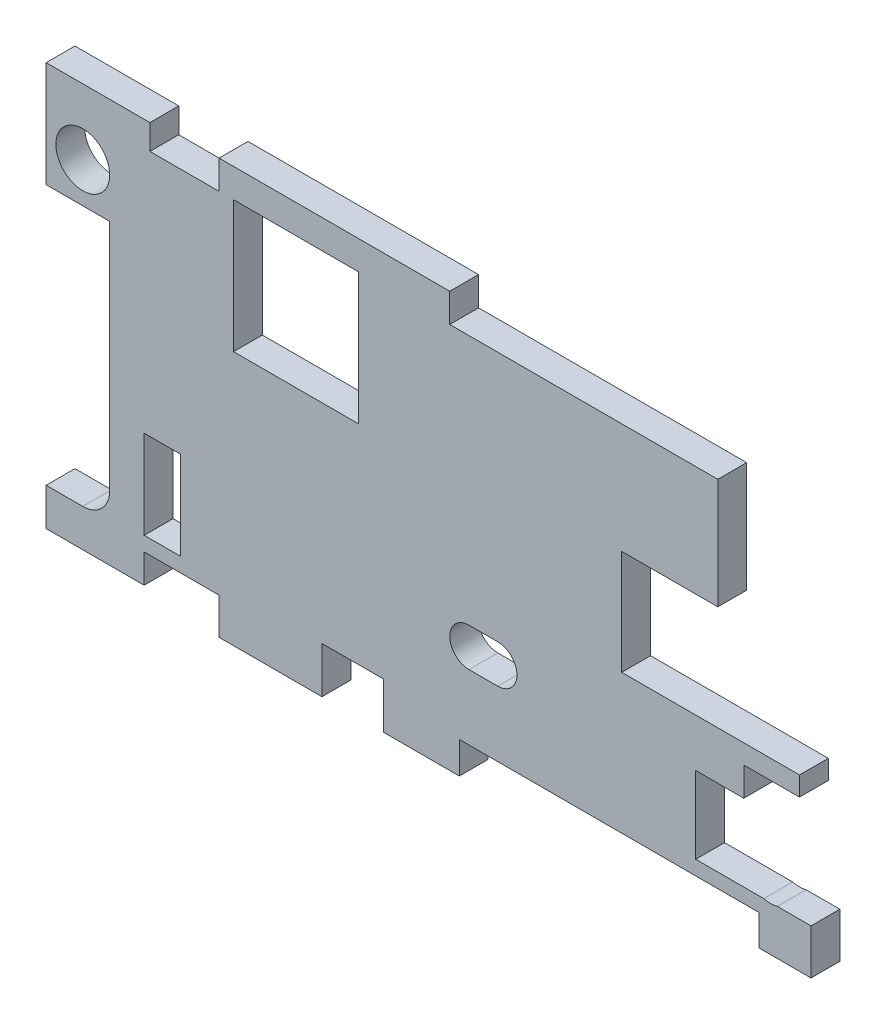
from build123d import *

# Parameters (mm, degrees)
SKETCH_1_R          = 2.8
SKETCH_1_W          = 5
SKETCH_1_H          = 4
EXTRUDE_1_DEPTH     = 3
SKETCH_2_W          = 4
SKETCH_2_H          = 0.3
SKETCH_2_W_2        = 23.4
SKETCH_2_H_2        = 1.3
SKETCH_2_W_3        = 6.4
SKETCH_2_W_4        = 3
SKETCH_2_H_3        = 10.6
SKETCH_2_H_4        = 4.8
SKETCH_2_W_5        = 10.2
SKETCH_2_H_5        = 2.3
SKETCH_2_W_6        = 18.5
SKETCH_2_H_6        = 11.4
CUT_EXTRUDE_1_DEPTH = 10
SKETCH_4_W          = 3.8
SKETCH_4_H          = 1.5
SKETCH_4_W_2        = 10
SKETCH_4_H_2        = 10
EXTRUDE_3_DEPTH     = 3
SKETCH_5_W          = 25
SKETCH_5_H          = 6
SKETCH_5_W_2        = 5.4
SKETCH_5_H_2        = 30.8
CUT_EXTRUDE_2_DEPTH = 10
SKETCH_6_W          = 1.2
SKETCH_6_H          = 10.6
SKETCH_6_W_2        = 10
SKETCH_6_H_2        = 1.5
SKETCH_6_W_3        = 24
SKETCH_6_H_3        = 3
EXTRUDE_4_DEPTH     = 3
SKETCH_7_W          = 6.4
SKETCH_7_H          = 5.9
CUT_EXTRUDE_3_DEPTH = 91.426765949
CUT_EXTRUDE_4_DEPTH = 10
SKETCH_9_W          = 1
SKETCH_9_H          = 3.2
CUT_EXTRUDE_5_DEPTH = 10


with BuildPart() as part:
    # Sketch 1 → Extrude 1 (new body)
    with BuildSketch(Plane.XY):
        Polygon((0, -12.3), (0, 0), (10.8, 0), (10.8, -2.6), (19.5, -2.6), (19.5, -16.3), (32.5, -16.3), (32.5, -2.6), (74.3, -2.6), (74.3, -11.9), (81.8, -11.9), (83.8, -11.9), (83.8, -42.7), (70.2, -42.7), (70.2, -32.1), (78.4, -32.1), (78.4, -14), (59.9, -14), (59.9, -25), (66.4, -25), (69.4, -25), (69.4, -28), (66.4, -28), (66.4, -40.8), (43, -40.8), (43, -48.8), (18, -48.8), (18, -39.3), (14, -39.3), (14, -28.3), (10.2, -28.3), (10.2, -44.3), (0, -44.3), (0, -32.3), (6.4, -32.3), (6.4, -12.3), align=None)
        with Locations((3.81, -6.84)):
            Circle(SKETCH_1_R, mode=Mode.SUBTRACT)
        with Locations((75.39, -35.29)):
            Circle(SKETCH_1_R, mode=Mode.SUBTRACT)
        with Locations((3.81, -35.29)):
            Circle(SKETCH_1_R, mode=Mode.SUBTRACT)
        with Locations((31.2, -40.8)):
            Rectangle(SKETCH_1_W, SKETCH_1_H, mode=Mode.SUBTRACT)
    extrude(amount=EXTRUDE_1_DEPTH)

    # Sketch 2 → Cut-Extrude 1 (cut)
    with BuildSketch(Plane.XY.offset(3)):
        with Locations((16, -39.15)):
            Rectangle(SKETCH_2_W, SKETCH_2_H)
        with Locations((54.7, -40.15)):
            Rectangle(SKETCH_2_W_2, SKETCH_2_H_2)
        with Locations((3.2, -11.65)):
            Rectangle(SKETCH_2_W_3, SKETCH_2_H_2)
        with Locations((71.7, -37.4)):
            Rectangle(SKETCH_2_W_4, SKETCH_2_H_3)
        with Locations((31.9, -40.4)):
            Rectangle(SKETCH_2_W_3, SKETCH_2_H_4)
        with Locations((5.1, -43.15)):
            Rectangle(SKETCH_2_W_5, SKETCH_2_H_5)
        with Locations((69.15, -8.3)):
            Rectangle(SKETCH_2_W_6, SKETCH_2_H_6)
    extrude(amount=-CUT_EXTRUDE_1_DEPTH, mode=Mode.SUBTRACT)


with BuildPart() as cut_extrude_1_piece_1:
    # of the separate pieces the step leaves, piece 1, a body of its own (cut_extrude_1_pieces)
    add(part.part.solids().sort_by_distance((0, -11, 0))[0])

    # Sketch 4 → Extrude 3 (add)
    with BuildSketch(Plane.XY.offset(3)):
        with Locations((12.1, -38.25)):
            Rectangle(SKETCH_4_W, SKETCH_4_H)
        Polygon((72.6, -27), (72.6, -30), (67.6, -30), (67.6, -38), (73.2, -38), (73.2, -39.5), (66.4, -39.5), (66.4, -25), (69.4, -25), (78.4, -25), (78.4, -27), align=None)
        with Locations((64.9, -7.6)):
            Rectangle(SKETCH_4_W_2, SKETCH_4_H_2)
    extrude(amount=-EXTRUDE_3_DEPTH)


with BuildPart() as cut_extrude_1_piece_2:
    # of the separate pieces the step leaves, piece 2, a body of its own (cut_extrude_1_pieces)
    add(part.part.solids().sort_by_distance((78.4, -32.1, 0))[0])


with BuildPart() as cut_extrude_1_piece_1_1:
    add(cut_extrude_1_piece_1.part)

    # Combine 2: union Cut-Extrude 1 piece 2
    add(cut_extrude_1_piece_2.part)

    # Sketch 5 → Cut-Extrude 2 (cut)
    with BuildSketch(Plane.XY.offset(3)):
        with Locations((30.5, -45.8)):
            Rectangle(SKETCH_5_W, SKETCH_5_H)
        with Locations((81.1, -27.3)):
            Rectangle(SKETCH_5_W_2, SKETCH_5_H_2)
    extrude(amount=-CUT_EXTRUDE_2_DEPTH, mode=Mode.SUBTRACT)

    # Sketch 6 → Extrude 4 (add)
    with BuildSketch(Plane.XY.offset(3)):
        with Locations((79, -37.4)):
            Rectangle(SKETCH_6_W, SKETCH_6_H)
        with Locations((64.9, -13.35)):
            Rectangle(SKETCH_6_W_2, SKETCH_6_H_2)
        with Locations((30, -1.1)):
            Rectangle(SKETCH_6_W_3, SKETCH_6_H_3)
    extrude(amount=-EXTRUDE_4_DEPTH)

    # Sketch 7 → Cut-Extrude 3 (cut, through all)
    with BuildSketch(Plane.XY.offset(3)):
        with BuildLine():
            Line((0, -32.3), (6.4, -32.29))
            Line((6.4, -32.29), (6.4, -11))
            Line((6.4, -11), (6.61, -11))
            Line((6.61, -11), (6.61, -32.29))
            Line((6.61, -32.29), (6.61, -35.29))
            ThreePointArc((6.61, -35.29), (5.789898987, -37.269898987), (3.81, -38.09))
            Line((3.81, -38.09), (0, -38.09))
            Line((0, -38.09), (0, -32.3))
        make_face()
        with Locations((76.4, -35.05)):
            Rectangle(SKETCH_7_W, SKETCH_7_H)
    extrude(amount=-CUT_EXTRUDE_3_DEPTH, mode=Mode.SUBTRACT)

    # Sketch 8 → Cut-Extrude 4 (cut)
    with BuildSketch(Plane.XY.offset(3)):
        with BuildLine():
            Line((44, -28.7), (47, -28.7))
            ThreePointArc((47, -28.7), (49, -30.7), (47, -32.7))
            Line((47, -32.7), (44, -32.7))
            ThreePointArc((44, -32.7), (42, -30.7), (44, -28.7))
        make_face()
    extrude(amount=-CUT_EXTRUDE_4_DEPTH, mode=Mode.SUBTRACT)

    # Sketch 9 → Cut-Extrude 5 (cut)
    with BuildSketch(Plane.XY.offset(3)):
        with Locations((73.7, -41.1)):
            Rectangle(SKETCH_9_W, SKETCH_9_H)
    extrude(amount=-CUT_EXTRUDE_5_DEPTH, mode=Mode.SUBTRACT)


solid = cut_extrude_1_piece_1_1.part
